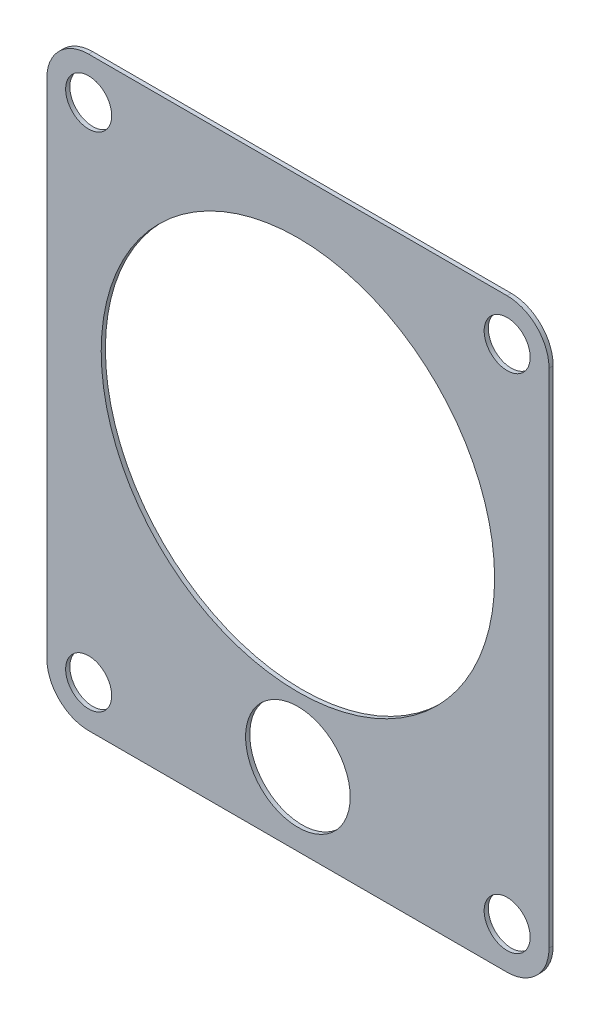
from build123d import *

# Parameters (mm, degrees)
ESQUISSE1_R          = 47
ESQUISSE1_R_2        = 12.5
ESQUISSE1_R_3        = 5.5
BASE_EXTRUSION_DEPTH = 1


with BuildPart() as part:
    # Esquisse1 → Base-Extrusion (new body)
    with BuildSketch(Plane.XY):
        with BuildLine():
            Line((10, 0), (110, 0))
            ThreePointArc((110, 0), (117.071067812, 2.928932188), (120, 10))
            Line((120, 10), (120, 130))
            ThreePointArc((120, 130), (117.071067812, 137.071067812), (110, 140))
            Line((110, 140), (10, 140))
            ThreePointArc((10, 140), (2.928932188, 137.071067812), (0, 130))
            Line((0, 130), (0, 10))
            ThreePointArc((0, 10), (2.928932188, 2.928932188), (10, 0))
        make_face()
        with Locations((60, 80)):
            Circle(ESQUISSE1_R, mode=Mode.SUBTRACT)
        with Locations((60, 17.5)):
            Circle(ESQUISSE1_R_2, mode=Mode.SUBTRACT)
        with Locations((10, 130)):
            Circle(ESQUISSE1_R_3, mode=Mode.SUBTRACT)
        with Locations((110, 130)):
            Circle(ESQUISSE1_R_3, mode=Mode.SUBTRACT)
        with Locations((10, 10)):
            Circle(ESQUISSE1_R_3, mode=Mode.SUBTRACT)
        with Locations((110, 10)):
            Circle(ESQUISSE1_R_3, mode=Mode.SUBTRACT)
    extrude(amount=BASE_EXTRUSION_DEPTH)


solid = part.part
